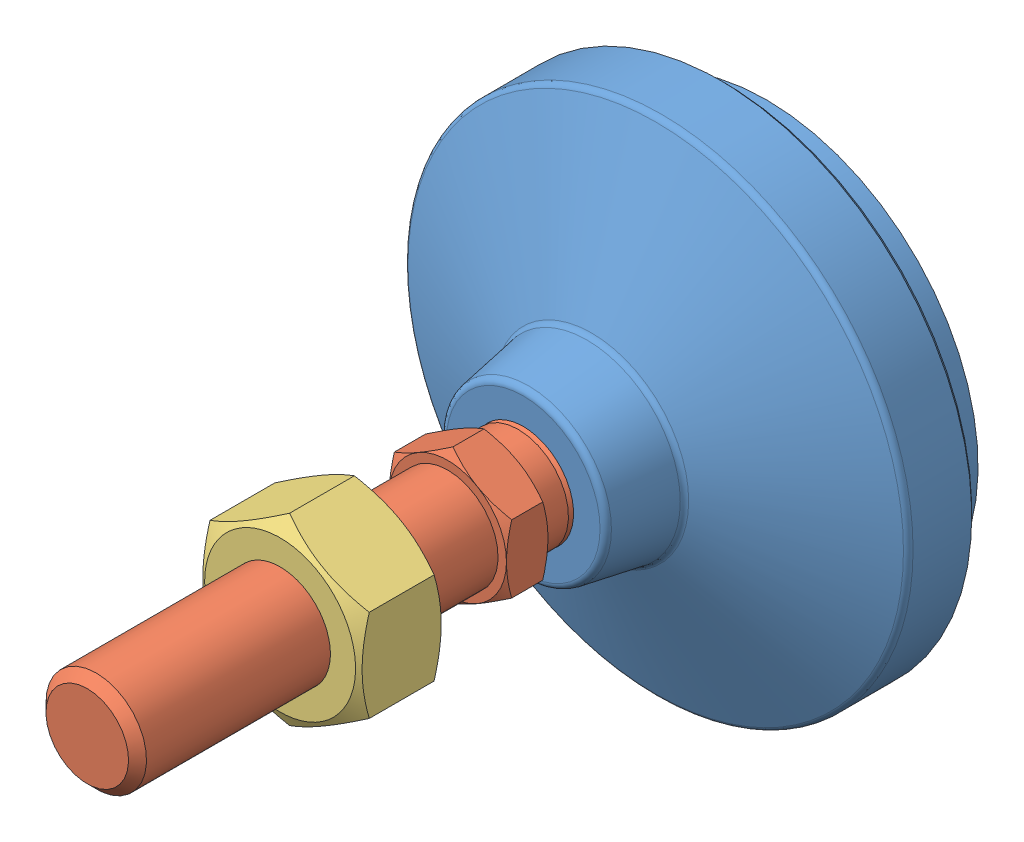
SolidWorks assembly LSVA50-M12X43-SUS.sldasm, configuration Default (file format 15000). Lengths in mm.
Overall size (60 60 81).
3 component instances, 3 part files, 0 mates.
Components (placement in the parent):
- LSVA50-M12X43-SUS_01-1: LSVA50-M12X43-SUS_01.sldprt [Default] at (0 0 5) x (1 0 0) z (0 -1 0) size (60 29 60)
- LSVA50-M12X43-SUS_02-1: LSVA50-M12X43-SUS_02.sldprt [Default] at (0 0 25.4) x (1 0 0) z (0 -1 0) size (14 62.6 16.17)
- LSVA50-M12X43-SUS_03-1: LSVA50-M12X43-SUS_03.sldprt [Default] at (0 0 48) size (19 21.94 10)
